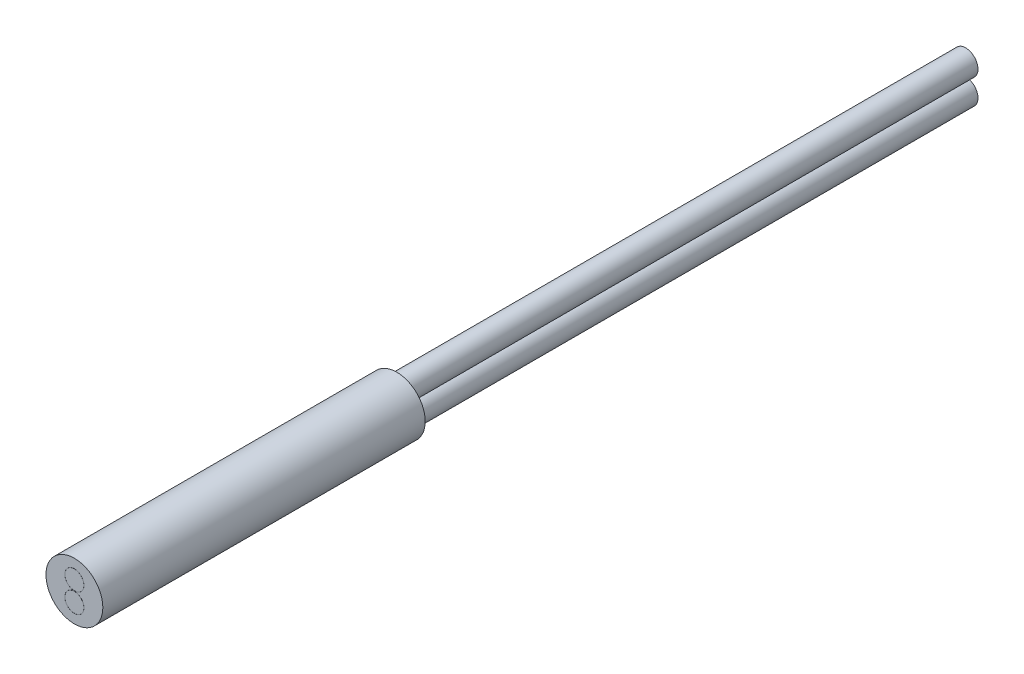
from build123d import *

# Parameters (mm, degrees)
SKETCH_1_R          = 1.5
EXTRUDE_1_DEPTH     = 17
SKETCH_2_R          = 0.65
EXTRUDE_2_DEPTH     = 30
SKETCH_3_R          = 0.505
SKETCH_3_R_2        = 0.5
CUT_EXTRUDE_1_DEPTH = 0.1


with BuildPart() as part:
    # Sketch 1 → Extrude 1 (new body)
    with BuildSketch(Plane.XY):
        Circle(SKETCH_1_R)
    extrude(amount=-EXTRUDE_1_DEPTH)

    # Sketch 2 → Extrude 2 (add)
    with BuildSketch(Plane(origin=(0, 0, -17), x_dir=(-1, 0, 0), z_dir=(0, 0, -1))):
        with Locations(Location((0, 0.66, 0), (0, 0, 180))):
            Circle(SKETCH_2_R)
        with Locations(Location((0, -0.66, 0), (0, 0, 180))):
            Circle(SKETCH_2_R)
    extrude(amount=EXTRUDE_2_DEPTH)

    # Sketch 3 → Cut-Extrude 1 (cut)
    # profile 1 of 2: a face of its own
    with BuildSketch(Plane.XY):
        with Locations((0, 0.515)):
            Circle(SKETCH_3_R)
        with Locations((0, 0.515)):
            Circle(SKETCH_3_R_2, mode=Mode.SUBTRACT)
    # profile 2 of 2: a face of its own
    with BuildSketch(Plane.XY):
        with Locations((0, -0.515)):
            Circle(SKETCH_3_R)
        with Locations((0, -0.515)):
            Circle(SKETCH_3_R_2, mode=Mode.SUBTRACT)
    extrude(amount=-CUT_EXTRUDE_1_DEPTH, mode=Mode.SUBTRACT)


solid = part.part
